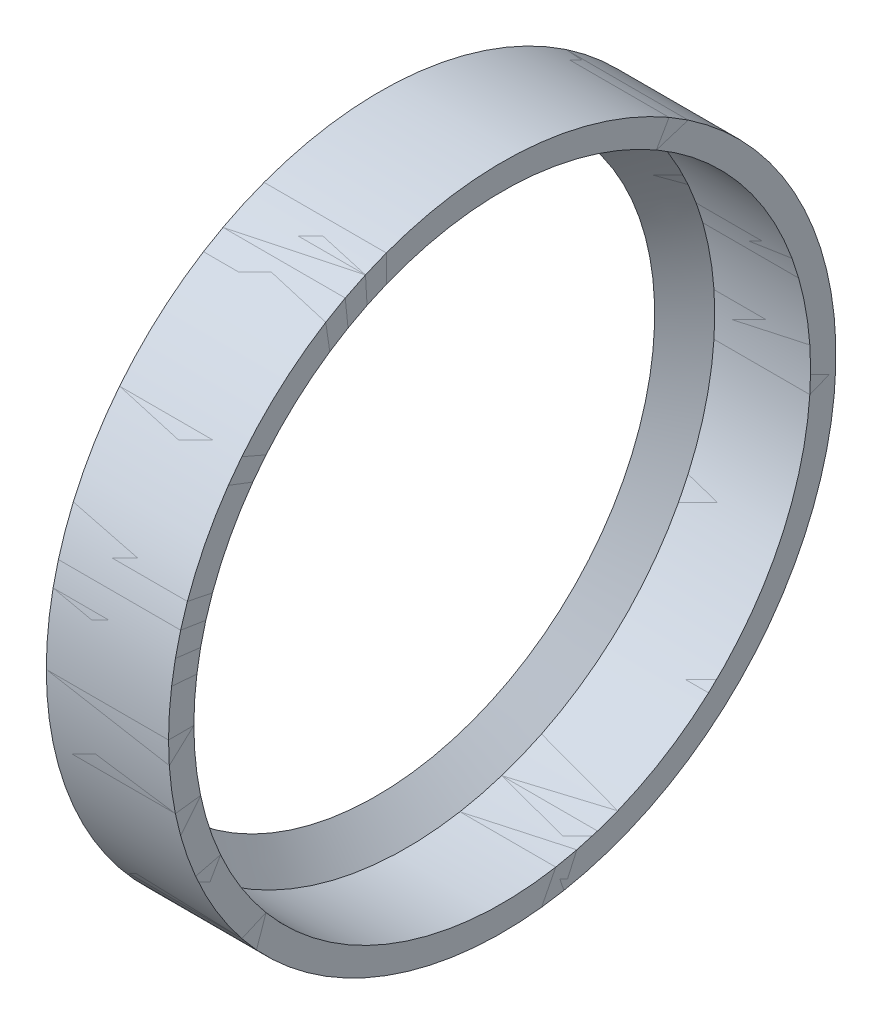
ISO-10303-21;
HEADER;
FILE_DESCRIPTION(('STEP AP214'),'2;1');
FILE_NAME('part.step','',(''),(''),'','','');
FILE_SCHEMA(('AUTOMOTIVE_DESIGN { 1 0 10303 214 1 1 1 1 }'));
ENDSEC;
DATA;
#1=APPLICATION_CONTEXT('core data for automotive mechanical design processes');
#2=APPLICATION_PROTOCOL_DEFINITION('international standard','automotive_design',2000,#1);
#3=PRODUCT_CONTEXT('',#1,'mechanical');
#4=PRODUCT('Part','Part','',(#3));
#5=PRODUCT_RELATED_PRODUCT_CATEGORY('part','',(#4));
#6=PRODUCT_DEFINITION_FORMATION('','',#4);
#7=PRODUCT_DEFINITION_CONTEXT('part definition',#1,'design');
#8=PRODUCT_DEFINITION('design','',#6,#7);
#9=PRODUCT_DEFINITION_SHAPE('','',#8);
#10=(LENGTH_UNIT() NAMED_UNIT(*) SI_UNIT(.MILLI.,.METRE.));
#11=(NAMED_UNIT(*) PLANE_ANGLE_UNIT() SI_UNIT($,.RADIAN.));
#12=(NAMED_UNIT(*) SI_UNIT($,.STERADIAN.) SOLID_ANGLE_UNIT());
#13=UNCERTAINTY_MEASURE_WITH_UNIT(LENGTH_MEASURE(1.E-05),#10,'distance_accuracy_value','');
#14=(GEOMETRIC_REPRESENTATION_CONTEXT(3) GLOBAL_UNCERTAINTY_ASSIGNED_CONTEXT((#13)) GLOBAL_UNIT_ASSIGNED_CONTEXT((#10,
#11,#12)) REPRESENTATION_CONTEXT('',''));
#15=CARTESIAN_POINT('',(0.,0.,0.));
#16=DIRECTION('',(0.,0.,1.));
#17=DIRECTION('',(1.,0.,0.));
#18=AXIS2_PLACEMENT_3D('',#15,#16,#17);
#19=CARTESIAN_POINT('',(-1.65922926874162,0.,0.));
#20=DIRECTION('',(-1.,0.,0.));
#21=DIRECTION('',(0.,0.,1.));
#22=AXIS2_PLACEMENT_3D('',#19,#20,#21);
#23=CYLINDRICAL_SURFACE('',#22,8.475);
#24=CARTESIAN_POINT('',(0.1,0.,0.));
#25=DIRECTION('',(-1.,0.,0.));
#26=DIRECTION('',(0.,0.,1.));
#27=AXIS2_PLACEMENT_3D('',#24,#25,#26);
#28=CIRCLE('',#27,8.475);
#29=CARTESIAN_POINT('',(0.1,0.,8.475));
#30=VERTEX_POINT('',#29);
#31=EDGE_CURVE('E76',#30,#30,#28,.T.);
#32=ORIENTED_EDGE('',*,*,#31,.T.);
#33=EDGE_LOOP('',(#32));
#34=FACE_BOUND('',#33,.T.);
#35=CARTESIAN_POINT('',(0.,0.,0.));
#36=DIRECTION('',(-1.,0.,0.));
#37=DIRECTION('',(0.,0.,1.));
#38=AXIS2_PLACEMENT_3D('',#35,#36,#37);
#39=CIRCLE('',#38,8.475);
#40=CARTESIAN_POINT('',(0.,0.,8.475));
#41=VERTEX_POINT('',#40);
#42=EDGE_CURVE('E11',#41,#41,#39,.T.);
#43=ORIENTED_EDGE('',*,*,#42,.F.);
#44=EDGE_LOOP('',(#43));
#45=FACE_BOUND('',#44,.T.);
#46=ADVANCED_FACE('F45',(#34,#45),#23,.T.);
#47=CARTESIAN_POINT('',(0.,-8.475,0.));
#48=DIRECTION('',(-1.,0.,0.));
#49=DIRECTION('',(0.,0.,1.));
#50=AXIS2_PLACEMENT_3D('',#47,#48,#49);
#51=PLANE('',#50);
#52=ORIENTED_EDGE('',*,*,#42,.T.);
#53=EDGE_LOOP('',(#52));
#54=FACE_BOUND('',#53,.T.);
#55=CARTESIAN_POINT('',(0.,0.,0.));
#56=DIRECTION('',(-1.,0.,0.));
#57=DIRECTION('',(0.,0.,1.));
#58=AXIS2_PLACEMENT_3D('',#55,#56,#57);
#59=CIRCLE('',#58,7.69499999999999);
#60=CARTESIAN_POINT('',(0.,0.,7.69499999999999));
#61=VERTEX_POINT('',#60);
#62=EDGE_CURVE('E52',#61,#61,#59,.T.);
#63=ORIENTED_EDGE('',*,*,#62,.F.);
#64=EDGE_LOOP('',(#63));
#65=FACE_BOUND('',#64,.T.);
#66=ADVANCED_FACE('F95',(#54,#65),#51,.T.);
#67=CARTESIAN_POINT('',(0.83,0.,0.));
#68=DIRECTION('',(1.,0.,0.));
#69=DIRECTION('',(0.,0.,-1.));
#70=AXIS2_PLACEMENT_3D('',#67,#68,#69);
#71=CONICAL_SURFACE('',#70,8.525,0.785398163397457);
#72=ORIENTED_EDGE('',*,*,#62,.T.);
#73=EDGE_LOOP('',(#72));
#74=FACE_BOUND('',#73,.T.);
#75=CARTESIAN_POINT('',(0.83,0.,0.));
#76=DIRECTION('',(-1.,0.,0.));
#77=DIRECTION('',(0.,0.,1.));
#78=AXIS2_PLACEMENT_3D('',#75,#76,#77);
#79=CIRCLE('',#78,8.525);
#80=CARTESIAN_POINT('',(0.83,0.,8.525));
#81=VERTEX_POINT('',#80);
#82=EDGE_CURVE('E57',#81,#81,#79,.T.);
#83=ORIENTED_EDGE('',*,*,#82,.F.);
#84=EDGE_LOOP('',(#83));
#85=FACE_BOUND('',#84,.T.);
#86=ADVANCED_FACE('F99',(#74,#85),#71,.F.);
#87=CARTESIAN_POINT('',(-1.65922926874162,0.,0.));
#88=DIRECTION('',(-1.,0.,0.));
#89=DIRECTION('',(0.,0.,1.));
#90=AXIS2_PLACEMENT_3D('',#87,#88,#89);
#91=CYLINDRICAL_SURFACE('',#90,8.525);
#92=ORIENTED_EDGE('',*,*,#82,.T.);
#93=EDGE_LOOP('',(#92));
#94=FACE_BOUND('',#93,.T.);
#95=CARTESIAN_POINT('',(3.48,0.,0.));
#96=DIRECTION('',(-1.,0.,0.));
#97=DIRECTION('',(0.,0.,1.));
#98=AXIS2_PLACEMENT_3D('',#95,#96,#97);
#99=CIRCLE('',#98,8.525);
#100=CARTESIAN_POINT('',(3.48,0.,8.525));
#101=VERTEX_POINT('',#100);
#102=EDGE_CURVE('E62',#101,#101,#99,.T.);
#103=ORIENTED_EDGE('',*,*,#102,.F.);
#104=EDGE_LOOP('',(#103));
#105=FACE_BOUND('',#104,.T.);
#106=ADVANCED_FACE('F103',(#94,#105),#91,.F.);
#107=CARTESIAN_POINT('',(3.48,-9.225,0.));
#108=DIRECTION('',(1.,0.,0.));
#109=DIRECTION('',(0.,0.,-1.));
#110=AXIS2_PLACEMENT_3D('',#107,#108,#109);
#111=PLANE('',#110);
#112=ORIENTED_EDGE('',*,*,#102,.T.);
#113=EDGE_LOOP('',(#112));
#114=FACE_BOUND('',#113,.T.);
#115=CARTESIAN_POINT('',(3.48,0.,0.));
#116=DIRECTION('',(-1.,0.,0.));
#117=DIRECTION('',(0.,0.,1.));
#118=AXIS2_PLACEMENT_3D('',#115,#116,#117);
#119=CIRCLE('',#118,9.225);
#120=CARTESIAN_POINT('',(3.48,0.,9.225));
#121=VERTEX_POINT('',#120);
#122=EDGE_CURVE('E68',#121,#121,#119,.T.);
#123=ORIENTED_EDGE('',*,*,#122,.F.);
#124=EDGE_LOOP('',(#123));
#125=FACE_BOUND('',#124,.T.);
#126=ADVANCED_FACE('F91',(#114,#125),#111,.T.);
#127=CARTESIAN_POINT('',(-1.65922926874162,0.,0.));
#128=DIRECTION('',(-1.,0.,0.));
#129=DIRECTION('',(0.,0.,1.));
#130=AXIS2_PLACEMENT_3D('',#127,#128,#129);
#131=CYLINDRICAL_SURFACE('',#130,9.225);
#132=ORIENTED_EDGE('',*,*,#122,.T.);
#133=EDGE_LOOP('',(#132));
#134=FACE_BOUND('',#133,.T.);
#135=CARTESIAN_POINT('',(0.1,0.,0.));
#136=DIRECTION('',(-1.,0.,0.));
#137=DIRECTION('',(0.,0.,1.));
#138=AXIS2_PLACEMENT_3D('',#135,#136,#137);
#139=CIRCLE('',#138,9.225);
#140=CARTESIAN_POINT('',(0.1,0.,9.225));
#141=VERTEX_POINT('',#140);
#142=EDGE_CURVE('E72',#141,#141,#139,.T.);
#143=ORIENTED_EDGE('',*,*,#142,.F.);
#144=EDGE_LOOP('',(#143));
#145=FACE_BOUND('',#144,.T.);
#146=ADVANCED_FACE('F85',(#134,#145),#131,.T.);
#147=CARTESIAN_POINT('',(0.1,-8.475,0.));
#148=DIRECTION('',(-1.,0.,0.));
#149=DIRECTION('',(0.,0.,1.));
#150=AXIS2_PLACEMENT_3D('',#147,#148,#149);
#151=PLANE('',#150);
#152=ORIENTED_EDGE('',*,*,#142,.T.);
#153=EDGE_LOOP('',(#152));
#154=FACE_BOUND('',#153,.T.);
#155=ORIENTED_EDGE('',*,*,#31,.F.);
#156=EDGE_LOOP('',(#155));
#157=FACE_BOUND('',#156,.T.);
#158=ADVANCED_FACE('F83',(#154,#157),#151,.T.);
#159=CLOSED_SHELL('',(#46,#66,#86,#106,#126,#146,#158));
#160=MANIFOLD_SOLID_BREP('B2',#159);
#161=CARTESIAN_POINT('',(0.,0.,0.));
#162=DIRECTION('',(1.,0.,0.));
#163=DIRECTION('',(0.,0.,-1.));
#164=AXIS2_PLACEMENT_3D('',#161,#162,#163);
#165=CONICAL_SURFACE('',#164,7.69499999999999,0.785398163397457);
#166=CARTESIAN_POINT('',(0.83,0.,0.));
#167=DIRECTION('',(-1.,0.,0.));
#168=DIRECTION('',(0.,0.,1.));
#169=AXIS2_PLACEMENT_3D('',#166,#167,#168);
#170=CIRCLE('',#169,8.525);
#171=CARTESIAN_POINT('',(0.83,0.,8.525));
#172=VERTEX_POINT('',#171);
#173=EDGE_CURVE('E184',#172,#172,#170,.T.);
#174=ORIENTED_EDGE('',*,*,#173,.F.);
#175=EDGE_LOOP('',(#174));
#176=FACE_BOUND('',#175,.T.);
#177=CARTESIAN_POINT('',(0.,0.,0.));
#178=DIRECTION('',(-1.,0.,0.));
#179=DIRECTION('',(0.,0.,1.));
#180=AXIS2_PLACEMENT_3D('',#177,#178,#179);
#181=CIRCLE('',#180,7.69499999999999);
#182=CARTESIAN_POINT('',(0.,0.,7.69499999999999));
#183=VERTEX_POINT('',#182);
#184=EDGE_CURVE('E44',#183,#183,#181,.T.);
#185=ORIENTED_EDGE('',*,*,#184,.T.);
#186=EDGE_LOOP('',(#185));
#187=FACE_BOUND('',#186,.T.);
#188=ADVANCED_FACE('F159',(#176,#187),#165,.F.);
#189=CARTESIAN_POINT('',(0.,7.69499999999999,0.));
#190=DIRECTION('',(1.,0.,0.));
#191=DIRECTION('',(0.,0.,-1.));
#192=AXIS2_PLACEMENT_3D('',#189,#190,#191);
#193=PLANE('',#192);
#194=ORIENTED_EDGE('',*,*,#184,.F.);
#195=EDGE_LOOP('',(#194));
#196=FACE_BOUND('',#195,.T.);
#197=CARTESIAN_POINT('',(0.,0.,0.));
#198=DIRECTION('',(-1.,0.,0.));
#199=DIRECTION('',(0.,0.,1.));
#200=AXIS2_PLACEMENT_3D('',#197,#198,#199);
#201=CIRCLE('',#200,8.475);
#202=CARTESIAN_POINT('',(0.,0.,8.475));
#203=VERTEX_POINT('',#202);
#204=EDGE_CURVE('E165',#203,#203,#201,.T.);
#205=ORIENTED_EDGE('',*,*,#204,.T.);
#206=EDGE_LOOP('',(#205));
#207=FACE_BOUND('',#206,.T.);
#208=ADVANCED_FACE('F191',(#196,#207),#193,.F.);
#209=CARTESIAN_POINT('',(-1.65922926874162,0.,0.));
#210=DIRECTION('',(-1.,0.,0.));
#211=DIRECTION('',(0.,0.,1.));
#212=AXIS2_PLACEMENT_3D('',#209,#210,#211);
#213=CYLINDRICAL_SURFACE('',#212,8.475);
#214=ORIENTED_EDGE('',*,*,#204,.F.);
#215=EDGE_LOOP('',(#214));
#216=FACE_BOUND('',#215,.T.);
#217=CARTESIAN_POINT('',(0.1,0.,0.));
#218=DIRECTION('',(-1.,0.,0.));
#219=DIRECTION('',(0.,0.,1.));
#220=AXIS2_PLACEMENT_3D('',#217,#218,#219);
#221=CIRCLE('',#220,8.475);
#222=CARTESIAN_POINT('',(0.1,0.,8.475));
#223=VERTEX_POINT('',#222);
#224=EDGE_CURVE('E169',#223,#223,#221,.T.);
#225=ORIENTED_EDGE('',*,*,#224,.T.);
#226=EDGE_LOOP('',(#225));
#227=FACE_BOUND('',#226,.T.);
#228=ADVANCED_FACE('F195',(#216,#227),#213,.T.);
#229=CARTESIAN_POINT('',(0.1,8.475,0.));
#230=DIRECTION('',(1.,0.,0.));
#231=DIRECTION('',(0.,0.,-1.));
#232=AXIS2_PLACEMENT_3D('',#229,#230,#231);
#233=PLANE('',#232);
#234=ORIENTED_EDGE('',*,*,#224,.F.);
#235=EDGE_LOOP('',(#234));
#236=FACE_BOUND('',#235,.T.);
#237=CARTESIAN_POINT('',(0.1,0.,0.));
#238=DIRECTION('',(-1.,0.,0.));
#239=DIRECTION('',(0.,0.,1.));
#240=AXIS2_PLACEMENT_3D('',#237,#238,#239);
#241=CIRCLE('',#240,9.225);
#242=CARTESIAN_POINT('',(0.1,0.,9.225));
#243=VERTEX_POINT('',#242);
#244=EDGE_CURVE('E173',#243,#243,#241,.T.);
#245=ORIENTED_EDGE('',*,*,#244,.T.);
#246=EDGE_LOOP('',(#245));
#247=FACE_BOUND('',#246,.T.);
#248=ADVANCED_FACE('F200',(#236,#247),#233,.F.);
#249=CARTESIAN_POINT('',(-1.65922926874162,0.,0.));
#250=DIRECTION('',(-1.,0.,0.));
#251=DIRECTION('',(0.,0.,1.));
#252=AXIS2_PLACEMENT_3D('',#249,#250,#251);
#253=CYLINDRICAL_SURFACE('',#252,9.225);
#254=ORIENTED_EDGE('',*,*,#244,.F.);
#255=EDGE_LOOP('',(#254));
#256=FACE_BOUND('',#255,.T.);
#257=CARTESIAN_POINT('',(3.48,0.,0.));
#258=DIRECTION('',(-1.,0.,0.));
#259=DIRECTION('',(0.,0.,1.));
#260=AXIS2_PLACEMENT_3D('',#257,#258,#259);
#261=CIRCLE('',#260,9.225);
#262=CARTESIAN_POINT('',(3.48,0.,9.225));
#263=VERTEX_POINT('',#262);
#264=EDGE_CURVE('E178',#263,#263,#261,.T.);
#265=ORIENTED_EDGE('',*,*,#264,.T.);
#266=EDGE_LOOP('',(#265));
#267=FACE_BOUND('',#266,.T.);
#268=ADVANCED_FACE('F206',(#256,#267),#253,.T.);
#269=CARTESIAN_POINT('',(3.48,9.225,0.));
#270=DIRECTION('',(-1.,0.,0.));
#271=DIRECTION('',(0.,0.,1.));
#272=AXIS2_PLACEMENT_3D('',#269,#270,#271);
#273=PLANE('',#272);
#274=ORIENTED_EDGE('',*,*,#264,.F.);
#275=EDGE_LOOP('',(#274));
#276=FACE_BOUND('',#275,.T.);
#277=CARTESIAN_POINT('',(3.48,0.,0.));
#278=DIRECTION('',(-1.,0.,0.));
#279=DIRECTION('',(0.,0.,1.));
#280=AXIS2_PLACEMENT_3D('',#277,#278,#279);
#281=CIRCLE('',#280,8.525);
#282=CARTESIAN_POINT('',(3.48,0.,8.525));
#283=VERTEX_POINT('',#282);
#284=EDGE_CURVE('E181',#283,#283,#281,.T.);
#285=ORIENTED_EDGE('',*,*,#284,.T.);
#286=EDGE_LOOP('',(#285));
#287=FACE_BOUND('',#286,.T.);
#288=ADVANCED_FACE('F210',(#276,#287),#273,.F.);
#289=CARTESIAN_POINT('',(-1.65922926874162,0.,0.));
#290=DIRECTION('',(-1.,0.,0.));
#291=DIRECTION('',(0.,0.,1.));
#292=AXIS2_PLACEMENT_3D('',#289,#290,#291);
#293=CYLINDRICAL_SURFACE('',#292,8.525);
#294=ORIENTED_EDGE('',*,*,#284,.F.);
#295=EDGE_LOOP('',(#294));
#296=FACE_BOUND('',#295,.T.);
#297=ORIENTED_EDGE('',*,*,#173,.T.);
#298=EDGE_LOOP('',(#297));
#299=FACE_BOUND('',#298,.T.);
#300=ADVANCED_FACE('F188',(#296,#299),#293,.F.);
#301=CLOSED_SHELL('',(#188,#208,#228,#248,#268,#288,#300));
#302=MANIFOLD_SOLID_BREP('B6',#301);
#303=ADVANCED_BREP_SHAPE_REPRESENTATION('',(#18,#160,#302),#14);
#304=SHAPE_DEFINITION_REPRESENTATION(#9,#303);
ENDSEC;
END-ISO-10303-21;
